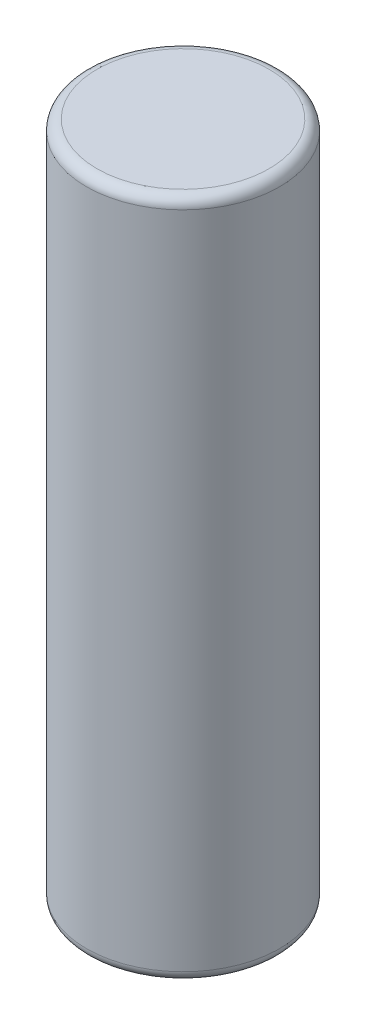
ISO-10303-21;
HEADER;
FILE_DESCRIPTION(('STEP AP214'),'2;1');
FILE_NAME('part.step','',(''),(''),'','','');
FILE_SCHEMA(('AUTOMOTIVE_DESIGN { 1 0 10303 214 1 1 1 1 }'));
ENDSEC;
DATA;
#1=APPLICATION_CONTEXT('core data for automotive mechanical design processes');
#2=APPLICATION_PROTOCOL_DEFINITION('international standard','automotive_design',2000,#1);
#3=PRODUCT_CONTEXT('',#1,'mechanical');
#4=PRODUCT('Part','Part','',(#3));
#5=PRODUCT_RELATED_PRODUCT_CATEGORY('part','',(#4));
#6=PRODUCT_DEFINITION_FORMATION('','',#4);
#7=PRODUCT_DEFINITION_CONTEXT('part definition',#1,'design');
#8=PRODUCT_DEFINITION('design','',#6,#7);
#9=PRODUCT_DEFINITION_SHAPE('','',#8);
#10=(LENGTH_UNIT() NAMED_UNIT(*) SI_UNIT(.MILLI.,.METRE.));
#11=(NAMED_UNIT(*) PLANE_ANGLE_UNIT() SI_UNIT($,.RADIAN.));
#12=(NAMED_UNIT(*) SI_UNIT($,.STERADIAN.) SOLID_ANGLE_UNIT());
#13=UNCERTAINTY_MEASURE_WITH_UNIT(LENGTH_MEASURE(1.E-05),#10,'distance_accuracy_value','');
#14=(GEOMETRIC_REPRESENTATION_CONTEXT(3) GLOBAL_UNCERTAINTY_ASSIGNED_CONTEXT((#13)) GLOBAL_UNIT_ASSIGNED_CONTEXT((#10,
#11,#12)) REPRESENTATION_CONTEXT('',''));
#15=CARTESIAN_POINT('',(0.,0.,0.));
#16=DIRECTION('',(0.,0.,1.));
#17=DIRECTION('',(1.,0.,0.));
#18=AXIS2_PLACEMENT_3D('',#15,#16,#17);
#19=CARTESIAN_POINT('',(0.,65.2,0.));
#20=DIRECTION('',(0.,-1.,0.));
#21=DIRECTION('',(0.,0.,-1.));
#22=AXIS2_PLACEMENT_3D('',#19,#20,#21);
#23=CYLINDRICAL_SURFACE('',#22,9.25);
#24=CARTESIAN_POINT('',(0.,1.,0.));
#25=DIRECTION('',(0.,1.,0.));
#26=DIRECTION('',(0.,0.,1.));
#27=AXIS2_PLACEMENT_3D('',#24,#25,#26);
#28=CIRCLE('',#27,9.25);
#29=CARTESIAN_POINT('',(0.,1.,9.25));
#30=VERTEX_POINT('',#29);
#31=EDGE_CURVE('E49',#30,#30,#28,.T.);
#32=ORIENTED_EDGE('',*,*,#31,.T.);
#33=EDGE_LOOP('',(#32));
#34=FACE_BOUND('',#33,.T.);
#35=CARTESIAN_POINT('',(0.,64.2,0.));
#36=DIRECTION('',(0.,1.,0.));
#37=DIRECTION('',(0.,0.,1.));
#38=AXIS2_PLACEMENT_3D('',#35,#36,#37);
#39=CIRCLE('',#38,9.25);
#40=CARTESIAN_POINT('',(0.,64.2,9.25));
#41=VERTEX_POINT('',#40);
#42=EDGE_CURVE('E53',#41,#41,#39,.F.);
#43=ORIENTED_EDGE('',*,*,#42,.T.);
#44=EDGE_LOOP('',(#43));
#45=FACE_BOUND('',#44,.T.);
#46=ADVANCED_FACE('F38',(#34,#45),#23,.T.);
#47=CARTESIAN_POINT('',(0.,65.2,0.));
#48=DIRECTION('',(0.,1.,0.));
#49=DIRECTION('',(0.,0.,1.));
#50=AXIS2_PLACEMENT_3D('',#47,#48,#49);
#51=PLANE('',#50);
#52=CARTESIAN_POINT('',(0.,65.2,0.));
#53=DIRECTION('',(0.,1.,0.));
#54=DIRECTION('',(0.,0.,1.));
#55=AXIS2_PLACEMENT_3D('',#52,#53,#54);
#56=CIRCLE('',#55,8.25);
#57=CARTESIAN_POINT('',(0.,65.2,8.25));
#58=VERTEX_POINT('',#57);
#59=EDGE_CURVE('E10',#58,#58,#56,.T.);
#60=ORIENTED_EDGE('',*,*,#59,.T.);
#61=EDGE_LOOP('',(#60));
#62=FACE_BOUND('',#61,.T.);
#63=ADVANCED_FACE('F69',(#62),#51,.T.);
#64=CARTESIAN_POINT('',(0.,0.,0.));
#65=DIRECTION('',(0.,1.,0.));
#66=DIRECTION('',(0.,0.,1.));
#67=AXIS2_PLACEMENT_3D('',#64,#65,#66);
#68=PLANE('',#67);
#69=CARTESIAN_POINT('',(0.,0.,0.));
#70=DIRECTION('',(0.,1.,0.));
#71=DIRECTION('',(0.,0.,1.));
#72=AXIS2_PLACEMENT_3D('',#69,#70,#71);
#73=CIRCLE('',#72,8.25);
#74=CARTESIAN_POINT('',(0.,0.,8.25));
#75=VERTEX_POINT('',#74);
#76=EDGE_CURVE('E45',#75,#75,#73,.F.);
#77=ORIENTED_EDGE('',*,*,#76,.T.);
#78=EDGE_LOOP('',(#77));
#79=FACE_BOUND('',#78,.T.);
#80=ADVANCED_FACE('F66',(#79),#68,.F.);
#81=CARTESIAN_POINT('',(0.,1.,0.));
#82=DIRECTION('',(0.,1.,0.));
#83=DIRECTION('',(0.,0.,1.));
#84=AXIS2_PLACEMENT_3D('',#81,#82,#83);
#85=TOROIDAL_SURFACE('',#84,8.25,1.);
#86=ORIENTED_EDGE('',*,*,#76,.F.);
#87=EDGE_LOOP('',(#86));
#88=FACE_BOUND('',#87,.T.);
#89=ORIENTED_EDGE('',*,*,#31,.F.);
#90=EDGE_LOOP('',(#89));
#91=FACE_BOUND('',#90,.T.);
#92=ADVANCED_FACE('F62',(#88,#91),#85,.T.);
#93=CARTESIAN_POINT('',(0.,64.2,0.));
#94=DIRECTION('',(0.,1.,0.));
#95=DIRECTION('',(0.,0.,1.));
#96=AXIS2_PLACEMENT_3D('',#93,#94,#95);
#97=TOROIDAL_SURFACE('',#96,8.25,1.);
#98=ORIENTED_EDGE('',*,*,#42,.F.);
#99=EDGE_LOOP('',(#98));
#100=FACE_BOUND('',#99,.T.);
#101=ORIENTED_EDGE('',*,*,#59,.F.);
#102=EDGE_LOOP('',(#101));
#103=FACE_BOUND('',#102,.T.);
#104=ADVANCED_FACE('F40',(#100,#103),#97,.T.);
#105=CLOSED_SHELL('',(#46,#63,#80,#92,#104));
#106=MANIFOLD_SOLID_BREP('B2',#105);
#107=ADVANCED_BREP_SHAPE_REPRESENTATION('',(#18,#106),#14);
#108=SHAPE_DEFINITION_REPRESENTATION(#9,#107);
ENDSEC;
END-ISO-10303-21;
